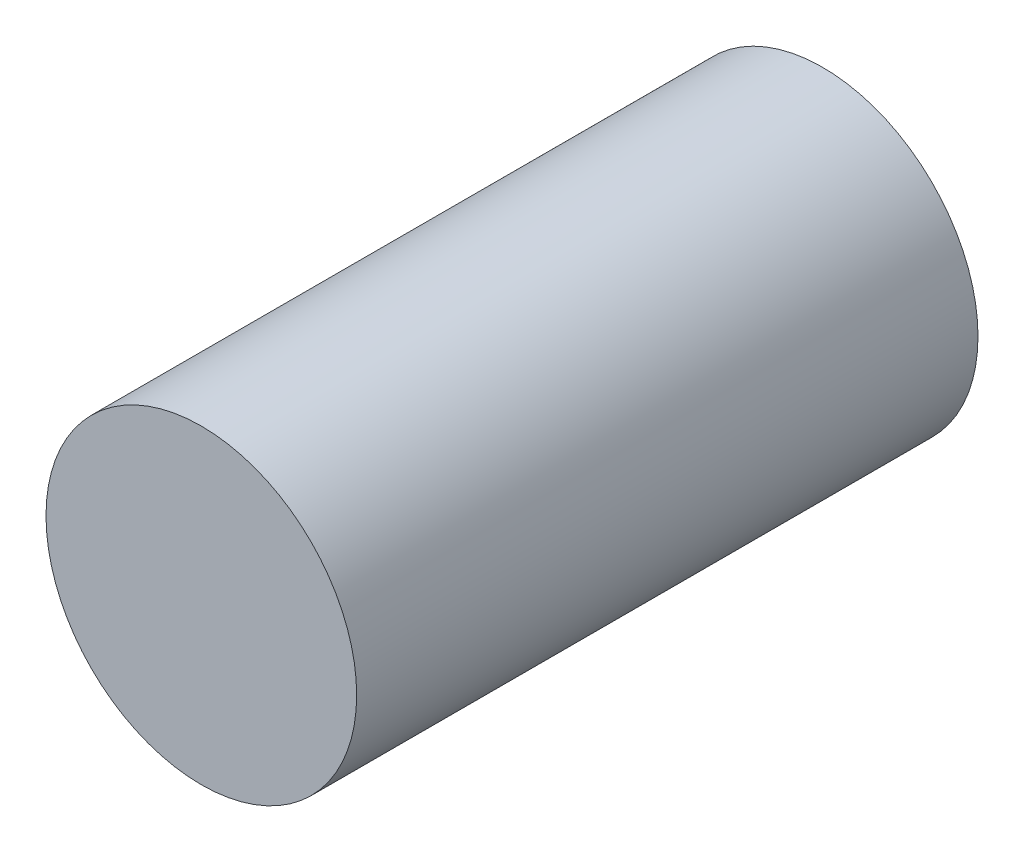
ISO-10303-21;
HEADER;
FILE_DESCRIPTION(('STEP AP214'),'2;1');
FILE_NAME('part.step','',(''),(''),'','','');
FILE_SCHEMA(('AUTOMOTIVE_DESIGN { 1 0 10303 214 1 1 1 1 }'));
ENDSEC;
DATA;
#1=APPLICATION_CONTEXT('core data for automotive mechanical design processes');
#2=APPLICATION_PROTOCOL_DEFINITION('international standard','automotive_design',2000,#1);
#3=PRODUCT_CONTEXT('',#1,'mechanical');
#4=PRODUCT('Part','Part','',(#3));
#5=PRODUCT_RELATED_PRODUCT_CATEGORY('part','',(#4));
#6=PRODUCT_DEFINITION_FORMATION('','',#4);
#7=PRODUCT_DEFINITION_CONTEXT('part definition',#1,'design');
#8=PRODUCT_DEFINITION('design','',#6,#7);
#9=PRODUCT_DEFINITION_SHAPE('','',#8);
#10=(LENGTH_UNIT() NAMED_UNIT(*) SI_UNIT(.MILLI.,.METRE.));
#11=(NAMED_UNIT(*) PLANE_ANGLE_UNIT() SI_UNIT($,.RADIAN.));
#12=(NAMED_UNIT(*) SI_UNIT($,.STERADIAN.) SOLID_ANGLE_UNIT());
#13=UNCERTAINTY_MEASURE_WITH_UNIT(LENGTH_MEASURE(1.E-05),#10,'distance_accuracy_value','');
#14=(GEOMETRIC_REPRESENTATION_CONTEXT(3) GLOBAL_UNCERTAINTY_ASSIGNED_CONTEXT((#13)) GLOBAL_UNIT_ASSIGNED_CONTEXT((#10,
#11,#12)) REPRESENTATION_CONTEXT('',''));
#15=CARTESIAN_POINT('',(0.,0.,0.));
#16=DIRECTION('',(0.,0.,1.));
#17=DIRECTION('',(1.,0.,0.));
#18=AXIS2_PLACEMENT_3D('',#15,#16,#17);
#19=CARTESIAN_POINT('',(0.,0.,18.));
#20=DIRECTION('',(0.,0.,1.));
#21=DIRECTION('',(1.,0.,0.));
#22=AXIS2_PLACEMENT_3D('',#19,#20,#21);
#23=PLANE('',#22);
#24=CARTESIAN_POINT('',(0.,0.,18.));
#25=DIRECTION('',(0.,0.,-1.));
#26=DIRECTION('',(-1.,0.,0.));
#27=AXIS2_PLACEMENT_3D('',#24,#25,#26);
#28=CIRCLE('',#27,9.);
#29=CARTESIAN_POINT('',(-9.,0.,18.));
#30=VERTEX_POINT('',#29);
#31=EDGE_CURVE('E10',#30,#30,#28,.T.);
#32=ORIENTED_EDGE('',*,*,#31,.F.);
#33=EDGE_LOOP('',(#32));
#34=FACE_BOUND('',#33,.T.);
#35=ADVANCED_FACE('F15',(#34),#23,.T.);
#36=CARTESIAN_POINT('',(0.,0.,-18.));
#37=DIRECTION('',(0.,0.,-1.));
#38=DIRECTION('',(-1.,0.,0.));
#39=AXIS2_PLACEMENT_3D('',#36,#37,#38);
#40=PLANE('',#39);
#41=CARTESIAN_POINT('',(0.,0.,-18.));
#42=DIRECTION('',(0.,0.,1.));
#43=DIRECTION('',(1.,0.,0.));
#44=AXIS2_PLACEMENT_3D('',#41,#42,#43);
#45=CIRCLE('',#44,9.);
#46=CARTESIAN_POINT('',(9.,0.,-18.));
#47=VERTEX_POINT('',#46);
#48=EDGE_CURVE('E22',#47,#47,#45,.T.);
#49=ORIENTED_EDGE('',*,*,#48,.F.);
#50=EDGE_LOOP('',(#49));
#51=FACE_BOUND('',#50,.T.);
#52=ADVANCED_FACE('F26',(#51),#40,.T.);
#53=CARTESIAN_POINT('',(0.,0.,-18.));
#54=DIRECTION('',(0.,0.,1.));
#55=DIRECTION('',(1.,0.,0.));
#56=AXIS2_PLACEMENT_3D('',#53,#54,#55);
#57=CYLINDRICAL_SURFACE('',#56,9.);
#58=ORIENTED_EDGE('',*,*,#31,.T.);
#59=EDGE_LOOP('',(#58));
#60=FACE_BOUND('',#59,.T.);
#61=ORIENTED_EDGE('',*,*,#48,.T.);
#62=EDGE_LOOP('',(#61));
#63=FACE_BOUND('',#62,.T.);
#64=ADVANCED_FACE('F17',(#60,#63),#57,.T.);
#65=CLOSED_SHELL('',(#35,#52,#64));
#66=MANIFOLD_SOLID_BREP('B1',#65);
#67=ADVANCED_BREP_SHAPE_REPRESENTATION('',(#18,#66),#14);
#68=SHAPE_DEFINITION_REPRESENTATION(#9,#67);
ENDSEC;
END-ISO-10303-21;
